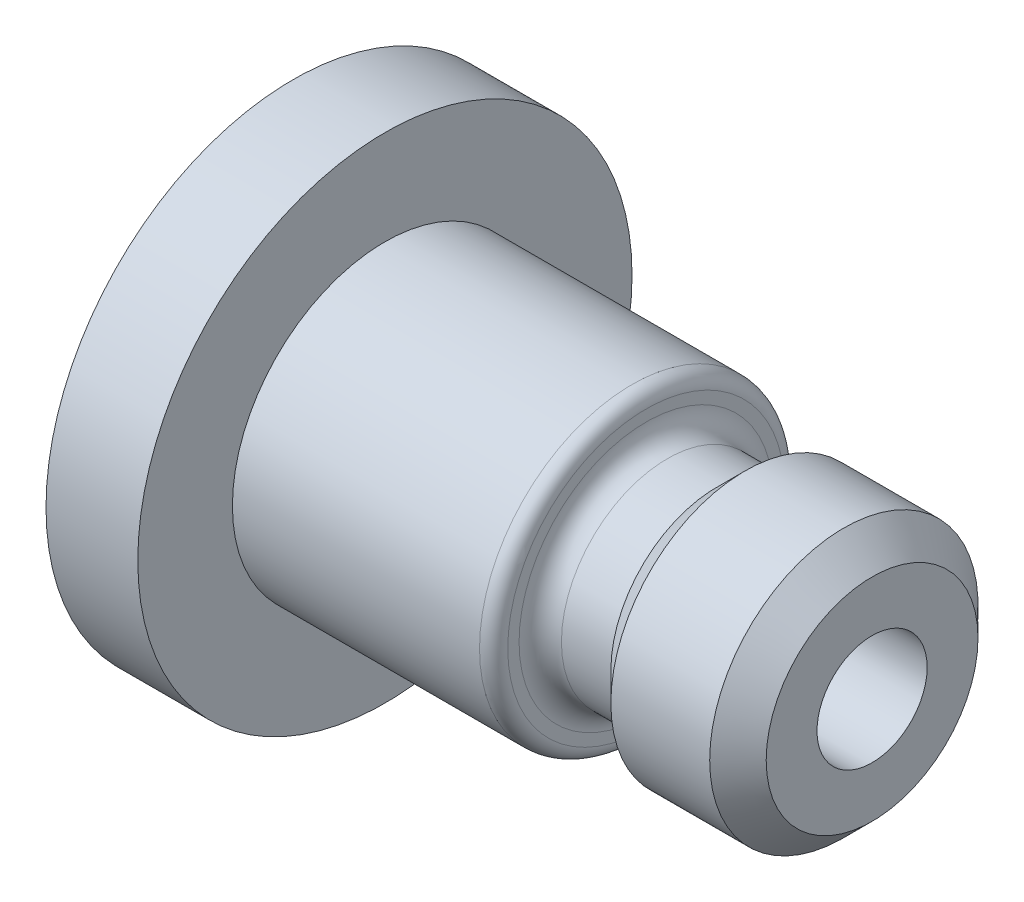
ISO-10303-21;
HEADER;
FILE_DESCRIPTION(('STEP AP214'),'2;1');
FILE_NAME('part.step','',(''),(''),'','','');
FILE_SCHEMA(('AUTOMOTIVE_DESIGN { 1 0 10303 214 1 1 1 1 }'));
ENDSEC;
DATA;
#1=APPLICATION_CONTEXT('core data for automotive mechanical design processes');
#2=APPLICATION_PROTOCOL_DEFINITION('international standard','automotive_design',2000,#1);
#3=PRODUCT_CONTEXT('',#1,'mechanical');
#4=PRODUCT('Part','Part','',(#3));
#5=PRODUCT_RELATED_PRODUCT_CATEGORY('part','',(#4));
#6=PRODUCT_DEFINITION_FORMATION('','',#4);
#7=PRODUCT_DEFINITION_CONTEXT('part definition',#1,'design');
#8=PRODUCT_DEFINITION('design','',#6,#7);
#9=PRODUCT_DEFINITION_SHAPE('','',#8);
#10=(LENGTH_UNIT() NAMED_UNIT(*) SI_UNIT(.MILLI.,.METRE.));
#11=(NAMED_UNIT(*) PLANE_ANGLE_UNIT() SI_UNIT($,.RADIAN.));
#12=(NAMED_UNIT(*) SI_UNIT($,.STERADIAN.) SOLID_ANGLE_UNIT());
#13=UNCERTAINTY_MEASURE_WITH_UNIT(LENGTH_MEASURE(1.E-05),#10,'distance_accuracy_value','');
#14=(GEOMETRIC_REPRESENTATION_CONTEXT(3) GLOBAL_UNCERTAINTY_ASSIGNED_CONTEXT((#13)) GLOBAL_UNIT_ASSIGNED_CONTEXT((#10,
#11,#12)) REPRESENTATION_CONTEXT('',''));
#15=CARTESIAN_POINT('',(0.,0.,0.));
#16=DIRECTION('',(0.,0.,1.));
#17=DIRECTION('',(1.,0.,0.));
#18=AXIS2_PLACEMENT_3D('',#15,#16,#17);
#19=CARTESIAN_POINT('',(0.,0.,0.));
#20=DIRECTION('',(1.,0.,0.));
#21=DIRECTION('',(0.,0.,-1.));
#22=AXIS2_PLACEMENT_3D('',#19,#20,#21);
#23=PLANE('',#22);
#24=CARTESIAN_POINT('',(0.,0.,0.));
#25=DIRECTION('',(-1.,0.,0.));
#26=DIRECTION('',(0.,0.,1.));
#27=AXIS2_PLACEMENT_3D('',#24,#25,#26);
#28=CIRCLE('',#27,4.445);
#29=CARTESIAN_POINT('',(0.,0.,4.445));
#30=VERTEX_POINT('',#29);
#31=EDGE_CURVE('E9',#30,#30,#28,.T.);
#32=ORIENTED_EDGE('',*,*,#31,.T.);
#33=EDGE_LOOP('',(#32));
#34=FACE_BOUND('',#33,.T.);
#35=ADVANCED_FACE('F14',(#34),#23,.F.);
#36=CARTESIAN_POINT('',(0.,0.,0.));
#37=DIRECTION('',(-1.,0.,0.));
#38=DIRECTION('',(0.,0.,1.));
#39=AXIS2_PLACEMENT_3D('',#36,#37,#38);
#40=CYLINDRICAL_SURFACE('',#39,4.445);
#41=ORIENTED_EDGE('',*,*,#31,.F.);
#42=EDGE_LOOP('',(#41));
#43=FACE_BOUND('',#42,.T.);
#44=CARTESIAN_POINT('',(1.651,0.,0.));
#45=DIRECTION('',(-1.,0.,0.));
#46=DIRECTION('',(0.,0.,1.));
#47=AXIS2_PLACEMENT_3D('',#44,#45,#46);
#48=CIRCLE('',#47,4.445);
#49=CARTESIAN_POINT('',(1.651,0.,4.445));
#50=VERTEX_POINT('',#49);
#51=EDGE_CURVE('E21',#50,#50,#48,.T.);
#52=ORIENTED_EDGE('',*,*,#51,.T.);
#53=EDGE_LOOP('',(#52));
#54=FACE_BOUND('',#53,.T.);
#55=ADVANCED_FACE('F109',(#43,#54),#40,.T.);
#56=CARTESIAN_POINT('',(1.651,4.445,0.));
#57=DIRECTION('',(-1.,0.,0.));
#58=DIRECTION('',(0.,0.,1.));
#59=AXIS2_PLACEMENT_3D('',#56,#57,#58);
#60=PLANE('',#59);
#61=ORIENTED_EDGE('',*,*,#51,.F.);
#62=EDGE_LOOP('',(#61));
#63=FACE_BOUND('',#62,.T.);
#64=CARTESIAN_POINT('',(1.651,0.,0.));
#65=DIRECTION('',(-1.,0.,0.));
#66=DIRECTION('',(0.,0.,1.));
#67=AXIS2_PLACEMENT_3D('',#64,#65,#66);
#68=CIRCLE('',#67,2.7432);
#69=CARTESIAN_POINT('',(1.651,0.,2.7432));
#70=VERTEX_POINT('',#69);
#71=EDGE_CURVE('E31',#70,#70,#68,.T.);
#72=ORIENTED_EDGE('',*,*,#71,.T.);
#73=EDGE_LOOP('',(#72));
#74=FACE_BOUND('',#73,.T.);
#75=ADVANCED_FACE('F114',(#63,#74),#60,.F.);
#76=CARTESIAN_POINT('',(0.,0.,0.));
#77=DIRECTION('',(-1.,0.,0.));
#78=DIRECTION('',(0.,0.,1.));
#79=AXIS2_PLACEMENT_3D('',#76,#77,#78);
#80=CYLINDRICAL_SURFACE('',#79,2.7432);
#81=ORIENTED_EDGE('',*,*,#71,.F.);
#82=EDGE_LOOP('',(#81));
#83=FACE_BOUND('',#82,.T.);
#84=CARTESIAN_POINT('',(6.096,0.,0.));
#85=DIRECTION('',(-1.,0.,0.));
#86=DIRECTION('',(0.,0.,1.));
#87=AXIS2_PLACEMENT_3D('',#84,#85,#86);
#88=CIRCLE('',#87,2.7432);
#89=CARTESIAN_POINT('',(6.096,0.,2.7432));
#90=VERTEX_POINT('',#89);
#91=EDGE_CURVE('E40',#90,#90,#88,.T.);
#92=ORIENTED_EDGE('',*,*,#91,.T.);
#93=EDGE_LOOP('',(#92));
#94=FACE_BOUND('',#93,.T.);
#95=ADVANCED_FACE('F120',(#83,#94),#80,.T.);
#96=CARTESIAN_POINT('',(6.096,0.,0.));
#97=DIRECTION('',(-1.,0.,0.));
#98=DIRECTION('',(0.,0.,1.));
#99=AXIS2_PLACEMENT_3D('',#96,#97,#98);
#100=TOROIDAL_SURFACE('',#99,2.4892,0.254);
#101=ORIENTED_EDGE('',*,*,#91,.F.);
#102=EDGE_LOOP('',(#101));
#103=FACE_BOUND('',#102,.T.);
#104=CARTESIAN_POINT('',(6.35,0.,0.));
#105=DIRECTION('',(-1.,0.,0.));
#106=DIRECTION('',(0.,0.,1.));
#107=AXIS2_PLACEMENT_3D('',#104,#105,#106);
#108=CIRCLE('',#107,2.4892);
#109=CARTESIAN_POINT('',(6.35,0.,2.4892));
#110=VERTEX_POINT('',#109);
#111=EDGE_CURVE('E45',#110,#110,#108,.T.);
#112=ORIENTED_EDGE('',*,*,#111,.T.);
#113=EDGE_LOOP('',(#112));
#114=FACE_BOUND('',#113,.T.);
#115=ADVANCED_FACE('F126',(#103,#114),#100,.T.);
#116=CARTESIAN_POINT('',(6.35,2.4892,0.));
#117=DIRECTION('',(-1.,0.,0.));
#118=DIRECTION('',(0.,0.,1.));
#119=AXIS2_PLACEMENT_3D('',#116,#117,#118);
#120=PLANE('',#119);
#121=ORIENTED_EDGE('',*,*,#111,.F.);
#122=EDGE_LOOP('',(#121));
#123=FACE_BOUND('',#122,.T.);
#124=CARTESIAN_POINT('',(6.35,0.,0.));
#125=DIRECTION('',(-1.,0.,0.));
#126=DIRECTION('',(0.,0.,1.));
#127=AXIS2_PLACEMENT_3D('',#124,#125,#126);
#128=CIRCLE('',#127,2.286);
#129=CARTESIAN_POINT('',(6.35,0.,2.286));
#130=VERTEX_POINT('',#129);
#131=EDGE_CURVE('E48',#130,#130,#128,.T.);
#132=ORIENTED_EDGE('',*,*,#131,.T.);
#133=EDGE_LOOP('',(#132));
#134=FACE_BOUND('',#133,.T.);
#135=ADVANCED_FACE('F130',(#123,#134),#120,.F.);
#136=CARTESIAN_POINT('',(6.731,0.,0.));
#137=DIRECTION('',(-1.,0.,0.));
#138=DIRECTION('',(0.,0.,1.));
#139=AXIS2_PLACEMENT_3D('',#136,#137,#138);
#140=TOROIDAL_SURFACE('',#139,2.286,0.381000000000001);
#141=ORIENTED_EDGE('',*,*,#131,.F.);
#142=EDGE_LOOP('',(#141));
#143=FACE_BOUND('',#142,.T.);
#144=CARTESIAN_POINT('',(6.731,0.,0.));
#145=DIRECTION('',(-1.,0.,0.));
#146=DIRECTION('',(0.,0.,1.));
#147=AXIS2_PLACEMENT_3D('',#144,#145,#146);
#148=CIRCLE('',#147,1.905);
#149=CARTESIAN_POINT('',(6.731,0.,1.905));
#150=VERTEX_POINT('',#149);
#151=EDGE_CURVE('E52',#150,#150,#148,.T.);
#152=ORIENTED_EDGE('',*,*,#151,.T.);
#153=EDGE_LOOP('',(#152));
#154=FACE_BOUND('',#153,.T.);
#155=ADVANCED_FACE('F134',(#143,#154),#140,.F.);
#156=CARTESIAN_POINT('',(0.,0.,0.));
#157=DIRECTION('',(-1.,0.,0.));
#158=DIRECTION('',(0.,0.,1.));
#159=AXIS2_PLACEMENT_3D('',#156,#157,#158);
#160=CYLINDRICAL_SURFACE('',#159,1.905);
#161=ORIENTED_EDGE('',*,*,#151,.F.);
#162=EDGE_LOOP('',(#161));
#163=FACE_BOUND('',#162,.T.);
#164=CARTESIAN_POINT('',(7.62,0.,0.));
#165=DIRECTION('',(-1.,0.,0.));
#166=DIRECTION('',(0.,0.,1.));
#167=AXIS2_PLACEMENT_3D('',#164,#165,#166);
#168=CIRCLE('',#167,1.905);
#169=CARTESIAN_POINT('',(7.62,0.,1.905));
#170=VERTEX_POINT('',#169);
#171=EDGE_CURVE('E56',#170,#170,#168,.T.);
#172=ORIENTED_EDGE('',*,*,#171,.T.);
#173=EDGE_LOOP('',(#172));
#174=FACE_BOUND('',#173,.T.);
#175=ADVANCED_FACE('F138',(#163,#174),#160,.T.);
#176=CARTESIAN_POINT('',(8.128,0.,0.));
#177=DIRECTION('',(1.,0.,0.));
#178=DIRECTION('',(0.,0.,-1.));
#179=AXIS2_PLACEMENT_3D('',#176,#177,#178);
#180=CONICAL_SURFACE('',#179,2.413,0.78539816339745);
#181=ORIENTED_EDGE('',*,*,#171,.F.);
#182=EDGE_LOOP('',(#181));
#183=FACE_BOUND('',#182,.T.);
#184=CARTESIAN_POINT('',(8.128,0.,0.));
#185=DIRECTION('',(-1.,0.,0.));
#186=DIRECTION('',(0.,0.,1.));
#187=AXIS2_PLACEMENT_3D('',#184,#185,#186);
#188=CIRCLE('',#187,2.413);
#189=CARTESIAN_POINT('',(8.128,0.,2.413));
#190=VERTEX_POINT('',#189);
#191=EDGE_CURVE('E59',#190,#190,#188,.T.);
#192=ORIENTED_EDGE('',*,*,#191,.T.);
#193=EDGE_LOOP('',(#192));
#194=FACE_BOUND('',#193,.T.);
#195=ADVANCED_FACE('F142',(#183,#194),#180,.T.);
#196=CARTESIAN_POINT('',(0.,0.,0.));
#197=DIRECTION('',(-1.,0.,0.));
#198=DIRECTION('',(0.,0.,1.));
#199=AXIS2_PLACEMENT_3D('',#196,#197,#198);
#200=CYLINDRICAL_SURFACE('',#199,2.413);
#201=ORIENTED_EDGE('',*,*,#191,.F.);
#202=EDGE_LOOP('',(#201));
#203=FACE_BOUND('',#202,.T.);
#204=CARTESIAN_POINT('',(9.906,0.,0.));
#205=DIRECTION('',(-1.,0.,0.));
#206=DIRECTION('',(0.,0.,1.));
#207=AXIS2_PLACEMENT_3D('',#204,#205,#206);
#208=CIRCLE('',#207,2.413);
#209=CARTESIAN_POINT('',(9.906,0.,2.413));
#210=VERTEX_POINT('',#209);
#211=EDGE_CURVE('E63',#210,#210,#208,.T.);
#212=ORIENTED_EDGE('',*,*,#211,.T.);
#213=EDGE_LOOP('',(#212));
#214=FACE_BOUND('',#213,.T.);
#215=ADVANCED_FACE('F146',(#203,#214),#200,.T.);
#216=CARTESIAN_POINT('',(10.414,0.,0.));
#217=DIRECTION('',(-1.,0.,0.));
#218=DIRECTION('',(0.,0.,1.));
#219=AXIS2_PLACEMENT_3D('',#216,#217,#218);
#220=CONICAL_SURFACE('',#219,1.905,0.78539816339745);
#221=ORIENTED_EDGE('',*,*,#211,.F.);
#222=EDGE_LOOP('',(#221));
#223=FACE_BOUND('',#222,.T.);
#224=CARTESIAN_POINT('',(10.414,0.,0.));
#225=DIRECTION('',(-1.,0.,0.));
#226=DIRECTION('',(0.,0.,1.));
#227=AXIS2_PLACEMENT_3D('',#224,#225,#226);
#228=CIRCLE('',#227,1.905);
#229=CARTESIAN_POINT('',(10.414,0.,1.905));
#230=VERTEX_POINT('',#229);
#231=EDGE_CURVE('E67',#230,#230,#228,.T.);
#232=ORIENTED_EDGE('',*,*,#231,.T.);
#233=EDGE_LOOP('',(#232));
#234=FACE_BOUND('',#233,.T.);
#235=ADVANCED_FACE('F150',(#223,#234),#220,.T.);
#236=CARTESIAN_POINT('',(10.414,1.905,0.));
#237=DIRECTION('',(-1.,0.,0.));
#238=DIRECTION('',(0.,0.,1.));
#239=AXIS2_PLACEMENT_3D('',#236,#237,#238);
#240=PLANE('',#239);
#241=CARTESIAN_POINT('',(10.414,0.,0.));
#242=DIRECTION('',(1.,0.,0.));
#243=DIRECTION('',(0.,0.,-1.));
#244=AXIS2_PLACEMENT_3D('',#241,#242,#243);
#245=CIRCLE('',#244,0.9906);
#246=CARTESIAN_POINT('',(10.414,0.,-0.9906));
#247=VERTEX_POINT('',#246);
#248=EDGE_CURVE('E79',#247,#247,#245,.T.);
#249=ORIENTED_EDGE('',*,*,#248,.F.);
#250=EDGE_LOOP('',(#249));
#251=FACE_BOUND('',#250,.T.);
#252=ORIENTED_EDGE('',*,*,#231,.F.);
#253=EDGE_LOOP('',(#252));
#254=FACE_BOUND('',#253,.T.);
#255=ADVANCED_FACE('F154',(#251,#254),#240,.F.);
#256=CARTESIAN_POINT('',(4.318,0.,0.));
#257=DIRECTION('',(-1.,0.,0.));
#258=DIRECTION('',(0.,0.,1.));
#259=AXIS2_PLACEMENT_3D('',#256,#257,#258);
#260=PLANE('',#259);
#261=CARTESIAN_POINT('',(4.318,0.,0.));
#262=DIRECTION('',(-1.,0.,0.));
#263=DIRECTION('',(0.,0.,1.));
#264=AXIS2_PLACEMENT_3D('',#261,#262,#263);
#265=CIRCLE('',#264,1.5);
#266=CARTESIAN_POINT('',(4.318,0.,1.5));
#267=VERTEX_POINT('',#266);
#268=EDGE_CURVE('E83',#267,#267,#265,.F.);
#269=ORIENTED_EDGE('',*,*,#268,.T.);
#270=EDGE_LOOP('',(#269));
#271=FACE_BOUND('',#270,.T.);
#272=ADVANCED_FACE('F92',(#271),#260,.F.);
#273=CARTESIAN_POINT('',(0.,0.,0.));
#274=DIRECTION('',(1.,0.,0.));
#275=DIRECTION('',(0.,0.,-1.));
#276=AXIS2_PLACEMENT_3D('',#273,#274,#275);
#277=CYLINDRICAL_SURFACE('',#276,0.9906);
#278=CARTESIAN_POINT('',(5.64007839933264,0.,0.));
#279=DIRECTION('',(-1.,0.,0.));
#280=DIRECTION('',(0.,0.,1.));
#281=AXIS2_PLACEMENT_3D('',#278,#279,#280);
#282=CIRCLE('',#281,0.9906);
#283=CARTESIAN_POINT('',(5.64007839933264,0.,0.9906));
#284=VERTEX_POINT('',#283);
#285=EDGE_CURVE('E71',#284,#284,#282,.T.);
#286=ORIENTED_EDGE('',*,*,#285,.T.);
#287=EDGE_LOOP('',(#286));
#288=FACE_BOUND('',#287,.T.);
#289=ORIENTED_EDGE('',*,*,#248,.T.);
#290=EDGE_LOOP('',(#289));
#291=FACE_BOUND('',#290,.T.);
#292=ADVANCED_FACE('F104',(#288,#291),#277,.F.);
#293=CARTESIAN_POINT('',(5.334,0.,0.));
#294=DIRECTION('',(-1.,0.,0.));
#295=DIRECTION('',(0.,0.,1.));
#296=AXIS2_PLACEMENT_3D('',#293,#294,#295);
#297=CONICAL_SURFACE('',#296,1.5,1.02974425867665);
#298=CARTESIAN_POINT('',(5.334,0.,0.));
#299=DIRECTION('',(-1.,0.,0.));
#300=DIRECTION('',(0.,0.,1.));
#301=AXIS2_PLACEMENT_3D('',#298,#299,#300);
#302=CIRCLE('',#301,1.5);
#303=CARTESIAN_POINT('',(5.334,0.,1.5));
#304=VERTEX_POINT('',#303);
#305=EDGE_CURVE('E75',#304,#304,#302,.T.);
#306=ORIENTED_EDGE('',*,*,#305,.T.);
#307=EDGE_LOOP('',(#306));
#308=FACE_BOUND('',#307,.T.);
#309=ORIENTED_EDGE('',*,*,#285,.F.);
#310=EDGE_LOOP('',(#309));
#311=FACE_BOUND('',#310,.T.);
#312=ADVANCED_FACE('F96',(#308,#311),#297,.F.);
#313=CARTESIAN_POINT('',(0.,0.,0.));
#314=DIRECTION('',(-1.,0.,0.));
#315=DIRECTION('',(0.,0.,1.));
#316=AXIS2_PLACEMENT_3D('',#313,#314,#315);
#317=CYLINDRICAL_SURFACE('',#316,1.5);
#318=ORIENTED_EDGE('',*,*,#305,.F.);
#319=EDGE_LOOP('',(#318));
#320=FACE_BOUND('',#319,.T.);
#321=ORIENTED_EDGE('',*,*,#268,.F.);
#322=EDGE_LOOP('',(#321));
#323=FACE_BOUND('',#322,.T.);
#324=ADVANCED_FACE('F94',(#320,#323),#317,.F.);
#325=CLOSED_SHELL('',(#35,#55,#75,#95,#115,#135,#155,#175,#195,#215,#235,#255,#272,#292,#312,#324));
#326=MANIFOLD_SOLID_BREP('B1',#325);
#327=ADVANCED_BREP_SHAPE_REPRESENTATION('',(#18,#326),#14);
#328=SHAPE_DEFINITION_REPRESENTATION(#9,#327);
ENDSEC;
END-ISO-10303-21;
